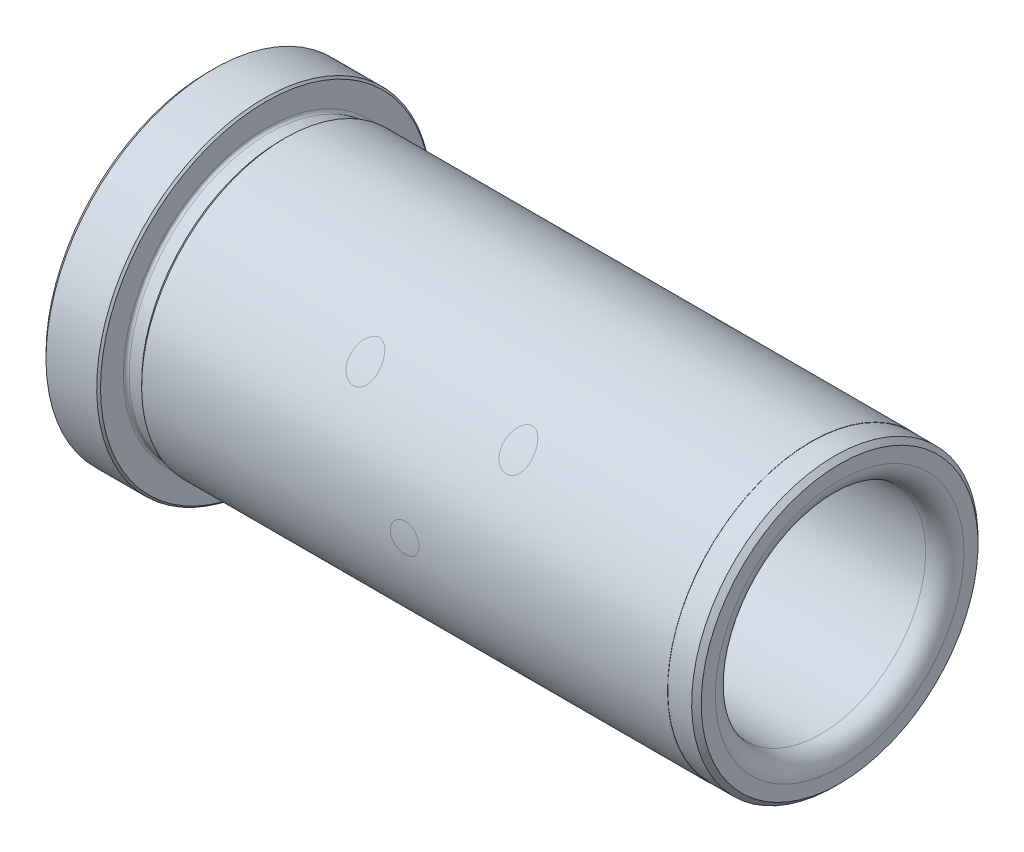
from build123d import *

# Parameters (mm, degrees)
SKETCH2_R      = 11
EXTRUDE1_DEPTH = 66
FILLET2_R      = 2
CHAMFER5_SIZE  = 0.2
CHAMFER3_SIZE  = 0.5
CHAMFER4_SIZE  = 0.5
CHAMFER7_SIZE  = 0.5


with BuildPart() as part:
    # Sketch1 → Revolve1 (revolve)
    with BuildSketch(Plane.XY):
        with BuildLine():
            Line((33, 14.975), (30, 14.975))
            Line((30, 14.975), (30, 15))
            Line((30, 15), (-25, 15))
            Line((-25, 15), (-25.4, 14.6))
            Line((-25.4, 14.6), (-26.7, 14.6))
            ThreePointArc((-26.7, 14.6), (-26.912132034, 14.687867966), (-27, 14.9))
            Line((-27, 14.9), (-27, 17.5))
            Line((-27, 17.5), (-33, 17.5))
            Line((-33, 17.5), (-33, 0))
            Line((-33, 0), (33, 0))
            Line((33, 0), (33, 14.975))
        make_face()
    revolve(axis=Axis((33, 0, 0), (-1, 0, 0)))

    # Sketch2 → Extrude1 (cut)
    with BuildSketch(Plane(origin=(33, 0, 0), x_dir=(0, 0, -1), z_dir=(1, 0, 0))):
        with Locations(Location((0, 0, 0), (0, 0, 90))):
            Circle(SKETCH2_R)
    extrude(amount=-EXTRUDE1_DEPTH, mode=Mode.SUBTRACT)

    # Fillet2
    fillet2_edges = [part.edges().sort_by_distance(p)[0] for p in [
        (33, -11, 0),
    ]]
    fillet(fillet2_edges, radius=FILLET2_R)

    # Chamfer5
    chamfer5_edges = [part.edges().sort_by_distance(p)[0] for p in [
        (-27, -17.5, 0),
    ]]
    chamfer(chamfer5_edges, length=CHAMFER5_SIZE)

    # Chamfer3
    chamfer3_edges = [part.edges().sort_by_distance(p)[0] for p in [
        (33, -14.975, 0),
    ]]
    chamfer(chamfer3_edges, length=CHAMFER3_SIZE)

    # Chamfer4
    chamfer4_edges = [part.edges().sort_by_distance(p)[0] for p in [
        (-33, -17.5, 0),
    ]]
    chamfer(chamfer4_edges, length=CHAMFER4_SIZE)

    # Chamfer7
    chamfer7_edges = [part.edges().sort_by_distance(p)[0] for p in [
        (-33, -11, 0),
    ]]
    chamfer(chamfer7_edges, length=CHAMFER7_SIZE)


solid = part.part
